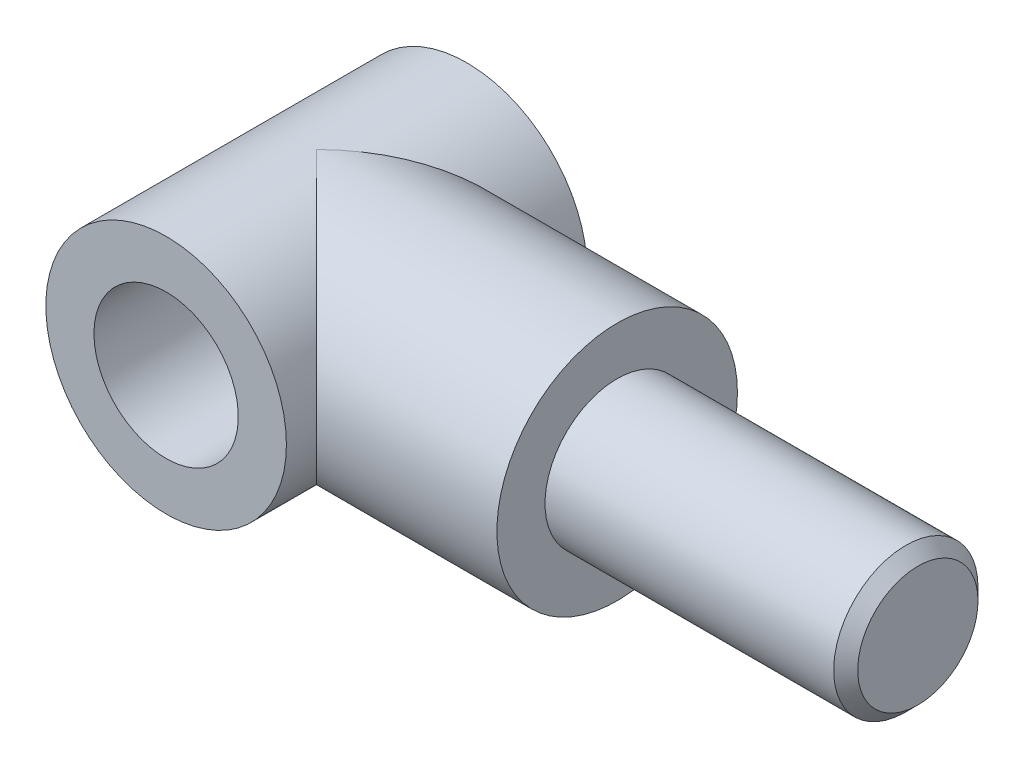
ISO-10303-21;
HEADER;
FILE_DESCRIPTION(('STEP AP214'),'2;1');
FILE_NAME('part.step','',(''),(''),'','','');
FILE_SCHEMA(('AUTOMOTIVE_DESIGN { 1 0 10303 214 1 1 1 1 }'));
ENDSEC;
DATA;
#1=APPLICATION_CONTEXT('core data for automotive mechanical design processes');
#2=APPLICATION_PROTOCOL_DEFINITION('international standard','automotive_design',2000,#1);
#3=PRODUCT_CONTEXT('',#1,'mechanical');
#4=PRODUCT('Part','Part','',(#3));
#5=PRODUCT_RELATED_PRODUCT_CATEGORY('part','',(#4));
#6=PRODUCT_DEFINITION_FORMATION('','',#4);
#7=PRODUCT_DEFINITION_CONTEXT('part definition',#1,'design');
#8=PRODUCT_DEFINITION('design','',#6,#7);
#9=PRODUCT_DEFINITION_SHAPE('','',#8);
#10=(LENGTH_UNIT() NAMED_UNIT(*) SI_UNIT(.MILLI.,.METRE.));
#11=(NAMED_UNIT(*) PLANE_ANGLE_UNIT() SI_UNIT($,.RADIAN.));
#12=(NAMED_UNIT(*) SI_UNIT($,.STERADIAN.) SOLID_ANGLE_UNIT());
#13=UNCERTAINTY_MEASURE_WITH_UNIT(LENGTH_MEASURE(1.E-05),#10,'distance_accuracy_value','');
#14=(GEOMETRIC_REPRESENTATION_CONTEXT(3) GLOBAL_UNCERTAINTY_ASSIGNED_CONTEXT((#13)) GLOBAL_UNIT_ASSIGNED_CONTEXT((#10,
#11,#12)) REPRESENTATION_CONTEXT('',''));
#15=CARTESIAN_POINT('',(0.,0.,0.));
#16=DIRECTION('',(0.,0.,1.));
#17=DIRECTION('',(1.,0.,0.));
#18=AXIS2_PLACEMENT_3D('',#15,#16,#17);
#19=CARTESIAN_POINT('',(25.,0.,12.5));
#20=DIRECTION('',(1.,0.,0.));
#21=DIRECTION('',(0.,0.,-1.));
#22=AXIS2_PLACEMENT_3D('',#19,#20,#21);
#23=PLANE('',#22);
#24=CARTESIAN_POINT('',(25.,0.,12.5));
#25=DIRECTION('',(1.,0.,0.));
#26=DIRECTION('',(0.,0.,-1.));
#27=AXIS2_PLACEMENT_3D('',#24,#25,#26);
#28=CIRCLE('',#27,10.);
#29=CARTESIAN_POINT('',(25.,0.,2.5));
#30=VERTEX_POINT('',#29);
#31=EDGE_CURVE('E106',#30,#30,#28,.T.);
#32=ORIENTED_EDGE('',*,*,#31,.T.);
#33=EDGE_LOOP('',(#32));
#34=FACE_BOUND('',#33,.T.);
#35=CARTESIAN_POINT('',(25.,0.,12.5));
#36=DIRECTION('',(1.,0.,0.));
#37=DIRECTION('',(0.,0.,-1.));
#38=AXIS2_PLACEMENT_3D('',#35,#36,#37);
#39=CIRCLE('',#38,6.);
#40=CARTESIAN_POINT('',(25.,0.,6.5));
#41=VERTEX_POINT('',#40);
#42=EDGE_CURVE('E111',#41,#41,#39,.T.);
#43=ORIENTED_EDGE('',*,*,#42,.F.);
#44=EDGE_LOOP('',(#43));
#45=FACE_BOUND('',#44,.T.);
#46=ADVANCED_FACE('F34',(#34,#45),#23,.T.);
#47=CARTESIAN_POINT('',(0.,0.,25.));
#48=DIRECTION('',(0.,0.,-1.));
#49=DIRECTION('',(-1.,0.,0.));
#50=AXIS2_PLACEMENT_3D('',#47,#48,#49);
#51=CYLINDRICAL_SURFACE('',#50,10.);
#52=CARTESIAN_POINT('',(0.,0.,0.));
#53=DIRECTION('',(0.,0.,1.));
#54=DIRECTION('',(1.,0.,0.));
#55=AXIS2_PLACEMENT_3D('',#52,#53,#54);
#56=CIRCLE('',#55,10.);
#57=CARTESIAN_POINT('',(10.,0.,0.));
#58=VERTEX_POINT('',#57);
#59=EDGE_CURVE('E57',#58,#58,#56,.T.);
#60=ORIENTED_EDGE('',*,*,#59,.T.);
#61=EDGE_LOOP('',(#60));
#62=FACE_BOUND('',#61,.T.);
#63=CARTESIAN_POINT('',(0.,0.,25.));
#64=DIRECTION('',(0.,0.,1.));
#65=DIRECTION('',(1.,0.,0.));
#66=AXIS2_PLACEMENT_3D('',#63,#64,#65);
#67=CIRCLE('',#66,10.);
#68=CARTESIAN_POINT('',(10.,0.,25.));
#69=VERTEX_POINT('',#68);
#70=EDGE_CURVE('E54',#69,#69,#67,.T.);
#71=ORIENTED_EDGE('',*,*,#70,.F.);
#72=EDGE_LOOP('',(#71));
#73=FACE_BOUND('',#72,.T.);
#74=CARTESIAN_POINT('',(0.,0.,12.5));
#75=DIRECTION('',(-0.707106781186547,0.,-0.707106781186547));
#76=DIRECTION('',(0.707106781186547,0.,-0.707106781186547));
#77=AXIS2_PLACEMENT_3D('',#74,#75,#76);
#78=ELLIPSE('',#77,14.142135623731,10.);
#79=CARTESIAN_POINT('',(0.,-10.,12.5));
#80=VERTEX_POINT('',#79);
#81=CARTESIAN_POINT('',(0.,10.,12.5));
#82=VERTEX_POINT('',#81);
#83=EDGE_CURVE('E50',#80,#82,#78,.F.);
#84=ORIENTED_EDGE('',*,*,#83,.F.);
#85=CARTESIAN_POINT('',(0.,0.,12.5));
#86=DIRECTION('',(0.707106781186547,0.,-0.707106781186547));
#87=DIRECTION('',(-0.707106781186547,0.,-0.707106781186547));
#88=AXIS2_PLACEMENT_3D('',#85,#86,#87);
#89=ELLIPSE('',#88,14.142135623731,10.);
#90=EDGE_CURVE('E48',#82,#80,#89,.T.);
#91=ORIENTED_EDGE('',*,*,#90,.F.);
#92=EDGE_LOOP('',(#84,#91));
#93=FACE_BOUND('',#92,.T.);
#94=ADVANCED_FACE('F36',(#62,#73,#93),#51,.T.);
#95=CARTESIAN_POINT('',(0.,0.,25.));
#96=DIRECTION('',(0.,0.,1.));
#97=DIRECTION('',(1.,0.,0.));
#98=AXIS2_PLACEMENT_3D('',#95,#96,#97);
#99=PLANE('',#98);
#100=CARTESIAN_POINT('',(0.,0.,25.));
#101=DIRECTION('',(0.,0.,-1.));
#102=DIRECTION('',(-1.,0.,0.));
#103=AXIS2_PLACEMENT_3D('',#100,#101,#102);
#104=CIRCLE('',#103,6.);
#105=CARTESIAN_POINT('',(-6.,0.,25.));
#106=VERTEX_POINT('',#105);
#107=EDGE_CURVE('E102',#106,#106,#104,.T.);
#108=ORIENTED_EDGE('',*,*,#107,.T.);
#109=EDGE_LOOP('',(#108));
#110=FACE_BOUND('',#109,.T.);
#111=ORIENTED_EDGE('',*,*,#70,.T.);
#112=EDGE_LOOP('',(#111));
#113=FACE_BOUND('',#112,.T.);
#114=ADVANCED_FACE('F81',(#110,#113),#99,.T.);
#115=CARTESIAN_POINT('',(0.,0.,0.));
#116=DIRECTION('',(0.,0.,1.));
#117=DIRECTION('',(1.,0.,0.));
#118=AXIS2_PLACEMENT_3D('',#115,#116,#117);
#119=PLANE('',#118);
#120=CARTESIAN_POINT('',(0.,0.,0.));
#121=DIRECTION('',(0.,0.,-1.));
#122=DIRECTION('',(-1.,0.,0.));
#123=AXIS2_PLACEMENT_3D('',#120,#121,#122);
#124=CIRCLE('',#123,6.);
#125=CARTESIAN_POINT('',(-6.,0.,0.));
#126=VERTEX_POINT('',#125);
#127=EDGE_CURVE('E107',#126,#126,#124,.T.);
#128=ORIENTED_EDGE('',*,*,#127,.F.);
#129=EDGE_LOOP('',(#128));
#130=FACE_BOUND('',#129,.T.);
#131=ORIENTED_EDGE('',*,*,#59,.F.);
#132=EDGE_LOOP('',(#131));
#133=FACE_BOUND('',#132,.T.);
#134=ADVANCED_FACE('F91',(#130,#133),#119,.F.);
#135=CARTESIAN_POINT('',(25.,0.,12.5));
#136=DIRECTION('',(-1.,0.,0.));
#137=DIRECTION('',(0.,0.,1.));
#138=AXIS2_PLACEMENT_3D('',#135,#136,#137);
#139=CYLINDRICAL_SURFACE('',#138,10.);
#140=ORIENTED_EDGE('',*,*,#31,.F.);
#141=EDGE_LOOP('',(#140));
#142=FACE_BOUND('',#141,.T.);
#143=ORIENTED_EDGE('',*,*,#90,.T.);
#144=ORIENTED_EDGE('',*,*,#83,.T.);
#145=EDGE_LOOP('',(#143,#144));
#146=FACE_BOUND('',#145,.T.);
#147=ADVANCED_FACE('F53',(#142,#146),#139,.T.);
#148=CARTESIAN_POINT('',(0.,0.,25.));
#149=DIRECTION('',(0.,0.,-1.));
#150=DIRECTION('',(-1.,0.,0.));
#151=AXIS2_PLACEMENT_3D('',#148,#149,#150);
#152=CYLINDRICAL_SURFACE('',#151,6.);
#153=ORIENTED_EDGE('',*,*,#107,.F.);
#154=EDGE_LOOP('',(#153));
#155=FACE_BOUND('',#154,.T.);
#156=ORIENTED_EDGE('',*,*,#127,.T.);
#157=EDGE_LOOP('',(#156));
#158=FACE_BOUND('',#157,.T.);
#159=ADVANCED_FACE('F87',(#155,#158),#152,.F.);
#160=CARTESIAN_POINT('',(50.,0.,12.5));
#161=DIRECTION('',(-1.,0.,0.));
#162=DIRECTION('',(0.,0.,1.));
#163=AXIS2_PLACEMENT_3D('',#160,#161,#162);
#164=CYLINDRICAL_SURFACE('',#163,6.);
#165=CARTESIAN_POINT('',(49.,0.,12.5));
#166=DIRECTION('',(1.,0.,0.));
#167=DIRECTION('',(0.,0.,-1.));
#168=AXIS2_PLACEMENT_3D('',#165,#166,#167);
#169=CIRCLE('',#168,6.);
#170=CARTESIAN_POINT('',(49.,0.,6.5));
#171=VERTEX_POINT('',#170);
#172=EDGE_CURVE('E11',#171,#171,#169,.F.);
#173=ORIENTED_EDGE('',*,*,#172,.T.);
#174=EDGE_LOOP('',(#173));
#175=FACE_BOUND('',#174,.T.);
#176=ORIENTED_EDGE('',*,*,#42,.T.);
#177=EDGE_LOOP('',(#176));
#178=FACE_BOUND('',#177,.T.);
#179=ADVANCED_FACE('F72',(#175,#178),#164,.T.);
#180=CARTESIAN_POINT('',(50.,0.,12.5));
#181=DIRECTION('',(1.,0.,0.));
#182=DIRECTION('',(0.,0.,-1.));
#183=AXIS2_PLACEMENT_3D('',#180,#181,#182);
#184=PLANE('',#183);
#185=CARTESIAN_POINT('',(50.,0.,12.5));
#186=DIRECTION('',(1.,0.,0.));
#187=DIRECTION('',(0.,0.,-1.));
#188=AXIS2_PLACEMENT_3D('',#185,#186,#187);
#189=CIRCLE('',#188,4.99999999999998);
#190=CARTESIAN_POINT('',(50.,0.,7.50000000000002));
#191=VERTEX_POINT('',#190);
#192=EDGE_CURVE('E42',#191,#191,#189,.T.);
#193=ORIENTED_EDGE('',*,*,#192,.T.);
#194=EDGE_LOOP('',(#193));
#195=FACE_BOUND('',#194,.T.);
#196=ADVANCED_FACE('F63',(#195),#184,.T.);
#197=CARTESIAN_POINT('',(50.,0.,12.5));
#198=DIRECTION('',(-1.,0.,0.));
#199=DIRECTION('',(0.,0.,1.));
#200=AXIS2_PLACEMENT_3D('',#197,#198,#199);
#201=CONICAL_SURFACE('',#200,4.99999999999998,0.785398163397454);
#202=ORIENTED_EDGE('',*,*,#172,.F.);
#203=EDGE_LOOP('',(#202));
#204=FACE_BOUND('',#203,.T.);
#205=ORIENTED_EDGE('',*,*,#192,.F.);
#206=EDGE_LOOP('',(#205));
#207=FACE_BOUND('',#206,.T.);
#208=ADVANCED_FACE('F65',(#204,#207),#201,.T.);
#209=CLOSED_SHELL('',(#46,#94,#114,#134,#147,#159,#179,#196,#208));
#210=MANIFOLD_SOLID_BREP('B2',#209);
#211=ADVANCED_BREP_SHAPE_REPRESENTATION('',(#18,#210),#14);
#212=SHAPE_DEFINITION_REPRESENTATION(#9,#211);
ENDSEC;
END-ISO-10303-21;
